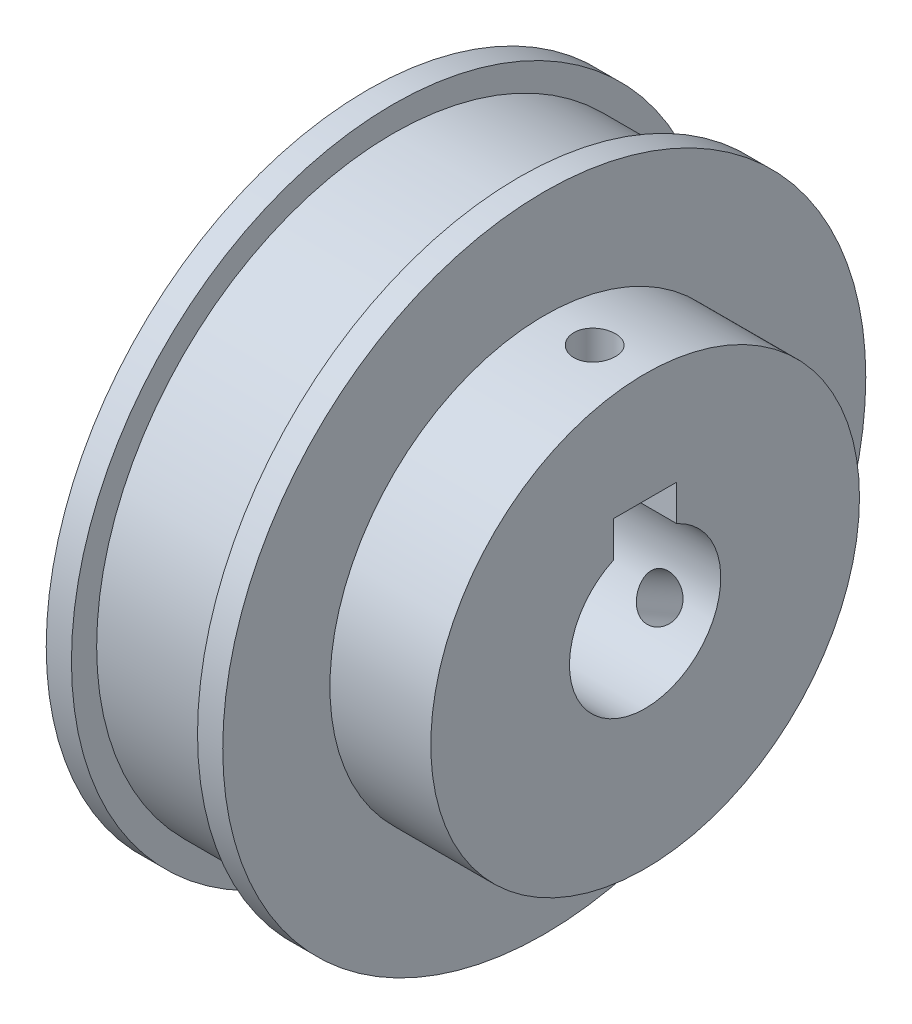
ISO-10303-21;
HEADER;
FILE_DESCRIPTION(('STEP AP214'),'2;1');
FILE_NAME('part.step','',(''),(''),'','','');
FILE_SCHEMA(('AUTOMOTIVE_DESIGN { 1 0 10303 214 1 1 1 1 }'));
ENDSEC;
DATA;
#1=APPLICATION_CONTEXT('core data for automotive mechanical design processes');
#2=APPLICATION_PROTOCOL_DEFINITION('international standard','automotive_design',2000,#1);
#3=PRODUCT_CONTEXT('',#1,'mechanical');
#4=PRODUCT('Part','Part','',(#3));
#5=PRODUCT_RELATED_PRODUCT_CATEGORY('part','',(#4));
#6=PRODUCT_DEFINITION_FORMATION('','',#4);
#7=PRODUCT_DEFINITION_CONTEXT('part definition',#1,'design');
#8=PRODUCT_DEFINITION('design','',#6,#7);
#9=PRODUCT_DEFINITION_SHAPE('','',#8);
#10=(LENGTH_UNIT() NAMED_UNIT(*) SI_UNIT(.MILLI.,.METRE.));
#11=(NAMED_UNIT(*) PLANE_ANGLE_UNIT() SI_UNIT($,.RADIAN.));
#12=(NAMED_UNIT(*) SI_UNIT($,.STERADIAN.) SOLID_ANGLE_UNIT());
#13=UNCERTAINTY_MEASURE_WITH_UNIT(LENGTH_MEASURE(1.E-05),#10,'distance_accuracy_value','');
#14=(GEOMETRIC_REPRESENTATION_CONTEXT(3) GLOBAL_UNCERTAINTY_ASSIGNED_CONTEXT((#13)) GLOBAL_UNIT_ASSIGNED_CONTEXT((#10,
#11,#12)) REPRESENTATION_CONTEXT('',''));
#15=CARTESIAN_POINT('',(0.,0.,0.));
#16=DIRECTION('',(0.,0.,1.));
#17=DIRECTION('',(1.,0.,0.));
#18=AXIS2_PLACEMENT_3D('',#15,#16,#17);
#19=CARTESIAN_POINT('',(14.,0.,0.));
#20=DIRECTION('',(1.,0.,0.));
#21=DIRECTION('',(0.,0.,-1.));
#22=AXIS2_PLACEMENT_3D('',#19,#20,#21);
#23=CYLINDRICAL_SURFACE('',#22,17.);
#24=CARTESIAN_POINT('',(18.,16.9197369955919,-1.65));
#25=CARTESIAN_POINT('',(18.092446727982,16.9197380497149,-1.64999598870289));
#26=CARTESIAN_POINT('',(18.1849549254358,16.9205028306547,-1.64220438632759));
#27=CARTESIAN_POINT('',(18.3674074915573,16.9234789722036,-1.61123929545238));
#28=CARTESIAN_POINT('',(18.4573489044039,16.9256919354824,-1.58804876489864));
#29=CARTESIAN_POINT('',(18.6319992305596,16.931311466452,-1.52696658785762));
#30=CARTESIAN_POINT('',(18.7167112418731,16.9347173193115,-1.4890837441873));
#31=CARTESIAN_POINT('',(18.8785557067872,16.9423379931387,-1.39970897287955));
#32=CARTESIAN_POINT('',(18.9556896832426,16.9465526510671,-1.34821978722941));
#33=CARTESIAN_POINT('',(19.100472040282,16.9553322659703,-1.23290381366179));
#34=CARTESIAN_POINT('',(19.1680907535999,16.9598982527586,-1.16903985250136));
#35=CARTESIAN_POINT('',(19.2916677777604,16.9688566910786,-1.03086650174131));
#36=CARTESIAN_POINT('',(19.3476255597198,16.973249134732,-0.956556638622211));
#37=CARTESIAN_POINT('',(19.4463941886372,16.981375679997,-0.799419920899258));
#38=CARTESIAN_POINT('',(19.4891788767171,16.9851084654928,-0.71657655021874));
#39=CARTESIAN_POINT('',(19.5602194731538,16.9914839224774,-0.544839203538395));
#40=CARTESIAN_POINT('',(19.588475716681,16.9941266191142,-0.455945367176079));
#41=CARTESIAN_POINT('',(19.6295705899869,16.9980169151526,-0.274929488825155));
#42=CARTESIAN_POINT('',(19.64245782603,16.9992689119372,-0.182818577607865));
#43=CARTESIAN_POINT('',(19.6525992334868,17.0002516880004,0.00226671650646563));
#44=CARTESIAN_POINT('',(19.6498537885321,16.9999825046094,0.0952410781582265));
#45=CARTESIAN_POINT('',(19.6288472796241,16.9979568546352,0.279084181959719));
#46=CARTESIAN_POINT('',(19.6106384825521,16.996205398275,0.369958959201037));
#47=CARTESIAN_POINT('',(19.5593035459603,16.9914178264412,0.547356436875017));
#48=CARTESIAN_POINT('',(19.5261772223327,16.9883816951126,0.633879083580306));
#49=CARTESIAN_POINT('',(19.4458900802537,16.9813575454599,0.800281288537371));
#50=CARTESIAN_POINT('',(19.3987060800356,16.9773679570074,0.880149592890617));
#51=CARTESIAN_POINT('',(19.2916597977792,16.9688846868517,1.03085313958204));
#52=CARTESIAN_POINT('',(19.2317971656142,16.964390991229,1.10168813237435));
#53=CARTESIAN_POINT('',(19.1007988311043,16.9553820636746,1.23262034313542));
#54=CARTESIAN_POINT('',(19.0296176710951,16.9508668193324,1.29267208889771));
#55=CARTESIAN_POINT('',(18.8781606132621,16.9423422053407,1.39998125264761));
#56=CARTESIAN_POINT('',(18.7978847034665,16.9383328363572,1.44723865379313));
#57=CARTESIAN_POINT('',(18.6304825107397,16.9312734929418,1.52761715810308));
#58=CARTESIAN_POINT('',(18.5433549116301,16.9282237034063,1.56073553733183));
#59=CARTESIAN_POINT('',(18.3647394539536,16.9234326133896,1.61186034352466));
#60=CARTESIAN_POINT('',(18.2732517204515,16.9216912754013,1.62986720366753));
#61=CARTESIAN_POINT('',(18.0889119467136,16.9197206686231,1.65019950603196));
#62=CARTESIAN_POINT('',(17.996066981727,16.9194852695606,1.65258852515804));
#63=CARTESIAN_POINT('',(17.8112980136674,16.9205370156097,1.64178421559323));
#64=CARTESIAN_POINT('',(17.7193739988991,16.9218241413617,1.62859108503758));
#65=CARTESIAN_POINT('',(17.5392411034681,16.9257703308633,1.58705013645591));
#66=CARTESIAN_POINT('',(17.451025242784,16.9284266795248,1.55873230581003));
#67=CARTESIAN_POINT('',(17.2805959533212,16.9348097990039,1.48777638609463));
#68=CARTESIAN_POINT('',(17.198382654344,16.9385365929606,1.44513798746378));
#69=CARTESIAN_POINT('',(17.04200221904,16.9466555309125,1.34659170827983));
#70=CARTESIAN_POINT('',(16.9678617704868,16.951049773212,1.29064165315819));
#71=CARTESIAN_POINT('',(16.8300020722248,16.9600015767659,1.16712081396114));
#72=CARTESIAN_POINT('',(16.7662830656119,16.9645591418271,1.09954975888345));
#73=CARTESIAN_POINT('',(16.6508561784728,16.9733425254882,0.954429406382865));
#74=CARTESIAN_POINT('',(16.5991897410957,16.9775671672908,0.876847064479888));
#75=CARTESIAN_POINT('',(16.5096196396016,16.9851916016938,0.71406990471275));
#76=CARTESIAN_POINT('',(16.4717157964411,16.9885914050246,0.628875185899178));
#77=CARTESIAN_POINT('',(16.4108172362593,16.9941777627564,0.453437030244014));
#78=CARTESIAN_POINT('',(16.3877973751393,16.9963663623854,0.363202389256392));
#79=CARTESIAN_POINT('',(16.3572381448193,16.9992920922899,0.180126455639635));
#80=CARTESIAN_POINT('',(16.349698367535,17.0000292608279,0.0872852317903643));
#81=CARTESIAN_POINT('',(16.3503188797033,16.9999690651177,-0.0979611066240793));
#82=CARTESIAN_POINT('',(16.3584147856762,16.9991779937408,-0.190366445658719));
#83=CARTESIAN_POINT('',(16.3899419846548,16.9961626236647,-0.372497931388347));
#84=CARTESIAN_POINT('',(16.4133732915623,16.9939383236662,-0.4622240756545));
#85=CARTESIAN_POINT('',(16.4748885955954,16.9883057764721,-0.636450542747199));
#86=CARTESIAN_POINT('',(16.5129708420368,16.9848976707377,-0.720951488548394));
#87=CARTESIAN_POINT('',(16.602700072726,16.977277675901,-0.882371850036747));
#88=CARTESIAN_POINT('',(16.6543469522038,16.973065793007,-0.959291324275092));
#89=CARTESIAN_POINT('',(16.7699809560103,16.9642895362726,-1.10369520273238));
#90=CARTESIAN_POINT('',(16.834015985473,16.9597238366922,-1.17114116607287));
#91=CARTESIAN_POINT('',(16.9725152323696,16.9507657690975,-1.29435973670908));
#92=CARTESIAN_POINT('',(17.0469819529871,16.9463734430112,-1.3501295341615));
#93=CARTESIAN_POINT('',(17.2044258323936,16.9382480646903,-1.44851751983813));
#94=CARTESIAN_POINT('',(17.2874230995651,16.9345166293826,-1.49110363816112));
#95=CARTESIAN_POINT('',(17.459372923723,16.9281548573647,-1.56167867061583));
#96=CARTESIAN_POINT('',(17.5483186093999,16.9255232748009,-1.58968410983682));
#97=CARTESIAN_POINT('',(17.6981433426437,16.9223253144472,-1.62329077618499));
#98=CARTESIAN_POINT('',(17.7580633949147,16.9213592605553,-1.63329311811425));
#99=CARTESIAN_POINT('',(17.8786468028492,16.9200647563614,-1.64664903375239));
#100=CARTESIAN_POINT('',(17.939310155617,16.9197363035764,-1.65000263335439));
#101=CARTESIAN_POINT('',(18.,16.9197369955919,-1.65));
#102=B_SPLINE_CURVE_WITH_KNOTS('',3,(#24,#25,#26,#27,#28,#29,#30,#31,#32,#33,#34,#35,#36,#37,
#38,#39,#40,#41,#42,#43,#44,#45,#46,#47,#48,#49,#50,#51,#52,#53,#54,#55,#56,#57,#58,#59,#60,#61,
#62,#63,#64,#65,#66,#67,#68,#69,#70,#71,#72,#73,#74,#75,#76,#77,#78,#79,#80,#81,#82,#83,#84,#85,
#86,#87,#88,#89,#90,#91,#92,#93,#94,#95,#96,#97,#98,#99,#100,#101),.UNSPECIFIED.,.T.,.F.,(4,2,2,
2,2,2,2,2,2,2,2,2,2,2,2,2,2,2,2,2,2,2,2,2,2,2,2,2,2,2,2,2,2,2,2,2,2,2,4),(0.,0.277118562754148,
0.554544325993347,0.831804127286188,1.10900809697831,1.38705805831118,1.665120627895,
1.94373185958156,2.22233666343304,2.50005799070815,2.77777250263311,3.05455204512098,
3.33133500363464,3.60857694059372,3.88582653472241,4.16421913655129,4.44261210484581,
4.72105868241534,4.99949727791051,5.27680169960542,5.55410259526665,5.83085572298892,
6.10761483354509,6.38526274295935,6.66291712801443,6.94151260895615,7.22010446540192,
7.4982244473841,7.77633709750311,8.05330699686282,8.3302771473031,8.60721421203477,
8.88414913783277,9.16217719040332,9.44027207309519,9.71903821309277,9.99748772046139,
10.1794124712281,10.3613365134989),.UNSPECIFIED.);
#103=CARTESIAN_POINT('',(18.,16.9197369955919,-1.65));
#104=VERTEX_POINT('',#103);
#105=EDGE_CURVE('E131',#104,#104,#102,.T.);
#106=ORIENTED_EDGE('',*,*,#105,.T.);
#107=EDGE_LOOP('',(#106));
#108=FACE_BOUND('',#107,.T.);
#109=CARTESIAN_POINT('',(14.,0.,0.));
#110=DIRECTION('',(1.,0.,0.));
#111=DIRECTION('',(0.,0.,-1.));
#112=AXIS2_PLACEMENT_3D('',#109,#110,#111);
#113=CIRCLE('',#112,17.);
#114=CARTESIAN_POINT('',(14.,0.,-17.));
#115=VERTEX_POINT('',#114);
#116=EDGE_CURVE('E109',#115,#115,#113,.T.);
#117=ORIENTED_EDGE('',*,*,#116,.T.);
#118=EDGE_LOOP('',(#117));
#119=FACE_BOUND('',#118,.T.);
#120=CARTESIAN_POINT('',(22.,0.,0.));
#121=DIRECTION('',(1.,0.,0.));
#122=DIRECTION('',(0.,0.,-1.));
#123=AXIS2_PLACEMENT_3D('',#120,#121,#122);
#124=CIRCLE('',#123,17.);
#125=CARTESIAN_POINT('',(22.,0.,-17.));
#126=VERTEX_POINT('',#125);
#127=EDGE_CURVE('E106',#126,#126,#124,.T.);
#128=ORIENTED_EDGE('',*,*,#127,.F.);
#129=EDGE_LOOP('',(#128));
#130=FACE_BOUND('',#129,.T.);
#131=CARTESIAN_POINT('',(18.,-9.88881041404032,-13.8279220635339));
#132=CARTESIAN_POINT('',(18.092446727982,-9.88880746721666,-13.8279249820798));
#133=CARTESIAN_POINT('',(18.1849549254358,-9.88244213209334,-13.8324831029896));
#134=CARTESIAN_POINT('',(18.3674074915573,-9.85711364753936,-13.8505430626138));
#135=CARTESIAN_POINT('',(18.4573489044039,-9.83813654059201,-13.8640548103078));
#136=CARTESIAN_POINT('',(18.6319992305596,-9.78804758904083,-13.8994625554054));
#137=CARTESIAN_POINT('',(18.7167112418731,-9.75694301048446,-13.9213535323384));
#138=CARTESIAN_POINT('',(18.8785557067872,-9.68335252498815,-13.9726406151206));
#139=CARTESIAN_POINT('',(18.9556896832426,-9.64086891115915,-14.0020352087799));
#140=CARTESIAN_POINT('',(19.100472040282,-9.54539215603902,-14.0672965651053));
#141=CARTESIAN_POINT('',(19.1680907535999,-9.49236733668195,-14.1031828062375));
#142=CARTESIAN_POINT('',(19.2916677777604,-9.37718492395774,-14.1800277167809));
#143=CARTESIAN_POINT('',(19.3476255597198,-9.31502691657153,-14.220986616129));
#144=CARTESIAN_POINT('',(19.4463941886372,-9.18300579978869,-14.306592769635));
#145=CARTESIAN_POINT('',(19.4891788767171,-9.11312772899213,-14.3512471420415));
#146=CARTESIAN_POINT('',(19.5602194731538,-8.96758655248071,-14.4426371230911));
#147=CARTESIAN_POINT('',(19.588475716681,-8.89192358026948,-14.4893726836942));
#148=CARTESIAN_POINT('',(19.6295705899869,-8.73710437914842,-14.5832497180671));
#149=CARTESIAN_POINT('',(19.64245782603,-8.6579599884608,-14.6303894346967));
#150=CARTESIAN_POINT('',(19.6525992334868,-8.49816280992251,-14.7237831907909));
#151=CARTESIAN_POINT('',(19.6498537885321,-8.41751005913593,-14.7700372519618));
#152=CARTESIAN_POINT('',(19.6288472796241,-8.25728443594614,-14.8602045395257));
#153=CARTESIAN_POINT('',(19.6106384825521,-8.17770884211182,-14.9041251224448));
#154=CARTESIAN_POINT('',(19.5593035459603,-8.02168433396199,-14.9886777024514));
#155=CARTESIAN_POINT('',(19.5261772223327,-7.94523545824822,-15.0293096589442));
#156=CARTESIAN_POINT('',(19.4458900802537,-7.7976148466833,-15.1064276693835));
#157=CARTESIAN_POINT('',(19.3987060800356,-7.72645207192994,-15.1429067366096));
#158=CARTESIAN_POINT('',(19.2916597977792,-7.59169733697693,-15.2109117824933));
#159=CARTESIAN_POINT('',(19.2317971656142,-7.52810558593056,-15.2424376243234));
#160=CARTESIAN_POINT('',(19.1007988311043,-7.4102105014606,-15.3001017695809));
#161=CARTESIAN_POINT('',(19.0296176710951,-7.35594654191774,-15.3262173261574));
#162=CARTESIAN_POINT('',(18.8781606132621,-7.25875177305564,-15.3724893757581));
#163=CARTESIAN_POINT('',(18.7978847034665,-7.21582097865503,-15.392645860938));
#164=CARTESIAN_POINT('',(18.6304825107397,-7.14268148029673,-15.4267215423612));
#165=CARTESIAN_POINT('',(18.5433549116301,-7.11247522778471,-15.4406395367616));
#166=CARTESIAN_POINT('',(18.3647394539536,-7.06580430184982,-15.4620527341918));
#167=CARTESIAN_POINT('',(18.2732517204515,-7.04933923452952,-15.4695481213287));
#168=CARTESIAN_POINT('',(18.0889119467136,-7.0307456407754,-15.4780076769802));
#169=CARTESIAN_POINT('',(17.996066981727,-7.02855898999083,-15.478998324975));
#170=CARTESIAN_POINT('',(17.8112980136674,-7.03844166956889,-15.4745070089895));
#171=CARTESIAN_POINT('',(17.7193739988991,-7.05051081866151,-15.4690251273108));
#172=CARTESIAN_POINT('',(17.5392411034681,-7.08845943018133,-15.4516721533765));
#173=CARTESIAN_POINT('',(17.451025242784,-7.11431156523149,-15.4398137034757));
#174=CARTESIAN_POINT('',(17.2805959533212,-7.17895275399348,-15.4098636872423));
#175=CARTESIAN_POINT('',(17.198382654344,-7.21774208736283,-15.3917719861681));
#176=CARTESIAN_POINT('',(17.04200221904,-7.3071451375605,-15.3495300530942));
#177=CARTESIAN_POINT('',(16.9678617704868,-7.35779642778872,-15.3253605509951));
#178=CARTESIAN_POINT('',(16.8300020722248,-7.46924451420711,-15.2713526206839));
#179=CARTESIAN_POINT('',(16.7662830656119,-7.53004154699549,-15.2415140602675));
#180=CARTESIAN_POINT('',(16.6508561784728,-7.66011115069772,-15.1765605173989));
#181=CARTESIAN_POINT('',(16.5991897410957,-7.72941175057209,-15.1414279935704));
#182=CARTESIAN_POINT('',(16.5096196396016,-7.87419312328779,-15.0666423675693));
#183=CARTESIAN_POINT('',(16.4717157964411,-7.94967381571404,-15.0269893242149));
#184=CARTESIAN_POINT('',(16.4108172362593,-8.10440089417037,-14.9441081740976));
#185=CARTESIAN_POINT('',(16.3877973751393,-8.18364068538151,-14.9008862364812));
#186=CARTESIAN_POINT('',(16.3572381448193,-8.34365195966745,-14.8118820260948));
#187=CARTESIAN_POINT('',(16.349698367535,-8.42442340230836,-14.7660998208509));
#188=CARTESIAN_POINT('',(16.3503188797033,-8.58482133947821,-14.6734245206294));
#189=CARTESIAN_POINT('',(16.3584147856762,-8.66445117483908,-14.6265367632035));
#190=CARTESIAN_POINT('',(16.3899419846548,-8.82067398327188,-14.532859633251));
#191=CARTESIAN_POINT('',(16.4133732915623,-8.89726695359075,-14.4860702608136));
#192=CARTESIAN_POINT('',(16.4748885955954,-9.04533522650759,-14.3940790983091));
#193=CARTESIAN_POINT('',(16.5129708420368,-9.11681113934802,-14.3488771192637));
#194=CARTESIAN_POINT('',(16.602700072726,-9.25279527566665,-14.2615678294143));
#195=CARTESIAN_POINT('',(16.6543469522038,-9.31730355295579,-14.2194604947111));
#196=CARTESIAN_POINT('',(16.7699809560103,-9.43797285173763,-14.1396580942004));
#197=CARTESIAN_POINT('',(16.834015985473,-9.49409991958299,-14.1019811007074));
#198=CARTESIAN_POINT('',(16.9725152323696,-9.59633129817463,-14.0326139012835));
#199=CARTESIAN_POINT('',(17.0469819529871,-9.64243319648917,-14.0009251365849));
#200=CARTESIAN_POINT('',(17.2044258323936,-9.72357700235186,-13.9446943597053));
#201=CARTESIAN_POINT('',(17.2874230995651,-9.75859194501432,-13.9201697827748));
#202=CARTESIAN_POINT('',(17.4593729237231,-9.81653082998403,-13.8793728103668));
#203=CARTESIAN_POINT('',(17.5483186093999,-9.83946846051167,-13.8630910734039));
#204=CARTESIAN_POINT('',(17.6981433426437,-9.86697370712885,-13.8435182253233));
#205=CARTESIAN_POINT('',(17.7580633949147,-9.87515296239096,-13.8376804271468));
#206=CARTESIAN_POINT('',(17.8786468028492,-9.88607227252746,-13.8298813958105));
#207=CARTESIAN_POINT('',(17.939310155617,-9.88881234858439,-13.8279201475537));
#208=CARTESIAN_POINT('',(18.,-9.88881041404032,-13.8279220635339));
#209=B_SPLINE_CURVE_WITH_KNOTS('',3,(#131,#132,#133,#134,#135,#136,#137,#138,#139,#140,#141,
#142,#143,#144,#145,#146,#147,#148,#149,#150,#151,#152,#153,#154,#155,#156,#157,#158,#159,#160,
#161,#162,#163,#164,#165,#166,#167,#168,#169,#170,#171,#172,#173,#174,#175,#176,#177,#178,#179,
#180,#181,#182,#183,#184,#185,#186,#187,#188,#189,#190,#191,#192,#193,#194,#195,#196,#197,#198,
#199,#200,#201,#202,#203,#204,#205,#206,#207,#208),.UNSPECIFIED.,.T.,.F.,(4,2,2,2,2,2,2,2,2,2,2,
2,2,2,2,2,2,2,2,2,2,2,2,2,2,2,2,2,2,2,2,2,2,2,2,2,2,2,4),(0.,0.277118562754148,
0.554544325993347,0.831804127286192,1.10900809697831,1.38705805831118,1.665120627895,
1.94373185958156,2.22233666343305,2.50005799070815,2.77777250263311,3.05455204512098,
3.33133500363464,3.60857694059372,3.88582653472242,4.16421913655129,4.44261210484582,
4.72105868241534,4.99949727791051,5.27680169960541,5.55410259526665,5.83085572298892,
6.10761483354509,6.38526274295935,6.66291712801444,6.94151260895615,7.22010446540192,
7.4982244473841,7.77633709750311,8.05330699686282,8.3302771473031,8.60721421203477,
8.88414913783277,9.16217719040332,9.4402720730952,9.71903821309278,9.9974877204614,
10.1794124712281,10.3613365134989),.UNSPECIFIED.);
#210=CARTESIAN_POINT('',(18.,-9.88881041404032,-13.8279220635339));
#211=VERTEX_POINT('',#210);
#212=EDGE_CURVE('E132',#211,#211,#209,.T.);
#213=ORIENTED_EDGE('',*,*,#212,.T.);
#214=EDGE_LOOP('',(#213));
#215=FACE_BOUND('',#214,.T.);
#216=ADVANCED_FACE('F33',(#108,#119,#130,#215),#23,.T.);
#217=CARTESIAN_POINT('',(0.,0.,0.));
#218=DIRECTION('',(1.,0.,0.));
#219=DIRECTION('',(0.,0.,-1.));
#220=AXIS2_PLACEMENT_3D('',#217,#218,#219);
#221=CYLINDRICAL_SURFACE('',#220,6.);
#222=CARTESIAN_POINT('',(22.,0.,0.));
#223=DIRECTION('',(1.,0.,0.));
#224=DIRECTION('',(0.,0.,-1.));
#225=AXIS2_PLACEMENT_3D('',#222,#223,#224);
#226=CIRCLE('',#225,6.);
#227=CARTESIAN_POINT('',(22.,5.45435605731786,2.5));
#228=VERTEX_POINT('',#227);
#229=CARTESIAN_POINT('',(22.,5.45435605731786,-2.5));
#230=VERTEX_POINT('',#229);
#231=EDGE_CURVE('E102',#228,#230,#226,.T.);
#232=ORIENTED_EDGE('',*,*,#231,.T.);
#233=DIRECTION('',(1.,0.,0.));
#234=VECTOR('',#233,1.);
#235=CARTESIAN_POINT('',(0.,5.45435605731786,-2.5));
#236=LINE('',#235,#234);
#237=CARTESIAN_POINT('',(0.,5.45435605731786,-2.5));
#238=VERTEX_POINT('',#237);
#239=EDGE_CURVE('E86',#238,#230,#236,.T.);
#240=ORIENTED_EDGE('',*,*,#239,.F.);
#241=CARTESIAN_POINT('',(0.,0.,0.));
#242=DIRECTION('',(1.,0.,0.));
#243=DIRECTION('',(0.,0.,-1.));
#244=AXIS2_PLACEMENT_3D('',#241,#242,#243);
#245=CIRCLE('',#244,6.);
#246=CARTESIAN_POINT('',(0.,5.45435605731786,2.5));
#247=VERTEX_POINT('',#246);
#248=EDGE_CURVE('E100',#247,#238,#245,.T.);
#249=ORIENTED_EDGE('',*,*,#248,.F.);
#250=DIRECTION('',(1.,0.,0.));
#251=VECTOR('',#250,1.);
#252=CARTESIAN_POINT('',(0.,5.45435605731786,2.5));
#253=LINE('',#252,#251);
#254=EDGE_CURVE('E77',#247,#228,#253,.T.);
#255=ORIENTED_EDGE('',*,*,#254,.T.);
#256=EDGE_LOOP('',(#232,#240,#249,#255));
#257=FACE_BOUND('',#256,.T.);
#258=CARTESIAN_POINT('',(18.,-4.31327459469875,-4.17081074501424));
#259=CARTESIAN_POINT('',(18.0907804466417,-4.31327362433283,-4.17081298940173));
#260=CARTESIAN_POINT('',(18.1815812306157,-4.30784748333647,-4.17644554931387));
#261=CARTESIAN_POINT('',(18.3605527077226,-4.28623748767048,-4.19861883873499));
#262=CARTESIAN_POINT('',(18.4487221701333,-4.27004867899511,-4.21516459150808));
#263=CARTESIAN_POINT('',(18.6198157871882,-4.2272222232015,-4.25811029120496));
#264=CARTESIAN_POINT('',(18.7027474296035,-4.20059990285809,-4.28449578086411));
#265=CARTESIAN_POINT('',(18.8613672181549,-4.13731330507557,-4.34563766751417));
#266=CARTESIAN_POINT('',(18.9370546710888,-4.10064806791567,-4.38039486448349));
#267=CARTESIAN_POINT('',(19.0810504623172,-4.0167854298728,-4.45743715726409));
#268=CARTESIAN_POINT('',(19.149137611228,-3.96935598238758,-4.49988316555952));
#269=CARTESIAN_POINT('',(19.274041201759,-3.86518479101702,-4.58966967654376));
#270=CARTESIAN_POINT('',(19.3308564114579,-3.80844203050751,-4.63701071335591));
#271=CARTESIAN_POINT('',(19.432534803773,-3.68551698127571,-4.73531982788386));
#272=CARTESIAN_POINT('',(19.4771767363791,-3.6191897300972,-4.78633612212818));
#273=CARTESIAN_POINT('',(19.5517961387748,-3.47920383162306,-4.88903512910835));
#274=CARTESIAN_POINT('',(19.5817762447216,-3.40554650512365,-4.94071772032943));
#275=CARTESIAN_POINT('',(19.6255012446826,-3.25457524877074,-5.04140546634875));
#276=CARTESIAN_POINT('',(19.6396227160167,-3.17739355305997,-5.09044516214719));
#277=CARTESIAN_POINT('',(19.6524157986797,-3.01991108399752,-5.18542050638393));
#278=CARTESIAN_POINT('',(19.6510901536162,-2.93961086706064,-5.23135670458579));
#279=CARTESIAN_POINT('',(19.6332888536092,-2.78049542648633,-5.31759535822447));
#280=CARTESIAN_POINT('',(19.6172202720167,-2.70169809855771,-5.35801582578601));
#281=CARTESIAN_POINT('',(19.5710486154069,-2.54581558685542,-5.43381442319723));
#282=CARTESIAN_POINT('',(19.5409447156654,-2.46873050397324,-5.46919225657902));
#283=CARTESIAN_POINT('',(19.4672538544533,-2.3178264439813,-5.53484670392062));
#284=CARTESIAN_POINT('',(19.4235301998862,-2.24404966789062,-5.56506656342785));
#285=CARTESIAN_POINT('',(19.3239466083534,-2.10288583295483,-5.61993016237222));
#286=CARTESIAN_POINT('',(19.268084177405,-2.03550009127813,-5.64457275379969));
#287=CARTESIAN_POINT('',(19.1436593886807,-1.90718105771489,-5.68923818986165));
#288=CARTESIAN_POINT('',(19.0747424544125,-1.84652964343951,-5.70908429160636));
#289=CARTESIAN_POINT('',(18.927279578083,-1.73646383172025,-5.74352055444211));
#290=CARTESIAN_POINT('',(18.8487329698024,-1.68705021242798,-5.75811035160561));
#291=CARTESIAN_POINT('',(18.683482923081,-1.60111117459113,-5.78259997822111));
#292=CARTESIAN_POINT('',(18.5967268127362,-1.56467728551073,-5.79246666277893));
#293=CARTESIAN_POINT('',(18.4179783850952,-1.5068294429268,-5.80778533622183));
#294=CARTESIAN_POINT('',(18.3259874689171,-1.48541149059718,-5.81323850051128));
#295=CARTESIAN_POINT('',(18.1425035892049,-1.45906904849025,-5.81990529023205));
#296=CARTESIAN_POINT('',(18.0510871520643,-1.45364360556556,-5.82124773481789));
#297=CARTESIAN_POINT('',(17.8686614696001,-1.45812266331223,-5.82012749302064));
#298=CARTESIAN_POINT('',(17.7776521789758,-1.46802541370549,-5.81766524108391));
#299=CARTESIAN_POINT('',(17.6005811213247,-1.502312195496,-5.80890325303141));
#300=CARTESIAN_POINT('',(17.5144558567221,-1.52639120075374,-5.80268427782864));
#301=CARTESIAN_POINT('',(17.3474483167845,-1.58772690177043,-5.78620127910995));
#302=CARTESIAN_POINT('',(17.2665667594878,-1.62498539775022,-5.775936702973));
#303=CARTESIAN_POINT('',(17.1102719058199,-1.71221465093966,-5.75068884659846));
#304=CARTESIAN_POINT('',(17.0350288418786,-1.76246008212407,-5.73560169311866));
#305=CARTESIAN_POINT('',(16.8939956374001,-1.87336633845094,-5.70034016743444));
#306=CARTESIAN_POINT('',(16.8282073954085,-1.9340292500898,-5.68016477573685));
#307=CARTESIAN_POINT('',(16.7058566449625,-2.06575142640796,-5.63362143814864));
#308=CARTESIAN_POINT('',(16.6496430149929,-2.13707451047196,-5.60708103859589));
#309=CARTESIAN_POINT('',(16.5506069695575,-2.28621888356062,-5.54793915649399));
#310=CARTESIAN_POINT('',(16.5077838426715,-2.36403982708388,-5.51533799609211));
#311=CARTESIAN_POINT('',(16.4371455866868,-2.52297737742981,-5.44445504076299));
#312=CARTESIAN_POINT('',(16.4092172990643,-2.60406395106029,-5.40621897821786));
#313=CARTESIAN_POINT('',(16.3688404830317,-2.7674078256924,-5.32445159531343));
#314=CARTESIAN_POINT('',(16.3563882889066,-2.84966484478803,-5.2809215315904));
#315=CARTESIAN_POINT('',(16.3475588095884,-3.01003117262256,-5.19113516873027));
#316=CARTESIAN_POINT('',(16.3506712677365,-3.08818832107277,-5.14501380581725));
#317=CARTESIAN_POINT('',(16.3716895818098,-3.2408779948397,-5.05022623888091));
#318=CARTESIAN_POINT('',(16.3895948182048,-3.315410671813,-5.00156014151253));
#319=CARTESIAN_POINT('',(16.4393947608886,-3.45838888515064,-4.90377376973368));
#320=CARTESIAN_POINT('',(16.4711801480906,-3.52687705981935,-4.85465992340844));
#321=CARTESIAN_POINT('',(16.5477408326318,-3.65695857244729,-4.75744211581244));
#322=CARTESIAN_POINT('',(16.5925180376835,-3.71855089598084,-4.7093383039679));
#323=CARTESIAN_POINT('',(16.6952520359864,-3.83536377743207,-4.61473686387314));
#324=CARTESIAN_POINT('',(16.7535428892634,-3.89035751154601,-4.56832197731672));
#325=CARTESIAN_POINT('',(16.8810237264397,-3.99105044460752,-4.48062318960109));
#326=CARTESIAN_POINT('',(16.9502166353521,-4.03674714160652,-4.43934067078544));
#327=CARTESIAN_POINT('',(17.0995178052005,-4.11915189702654,-4.36300634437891));
#328=CARTESIAN_POINT('',(17.1798466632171,-4.15562013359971,-4.3281262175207));
#329=CARTESIAN_POINT('',(17.3479256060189,-4.21753730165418,-4.26781669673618));
#330=CARTESIAN_POINT('',(17.4356710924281,-4.24299300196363,-4.24238149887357));
#331=CARTESIAN_POINT('',(17.6024963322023,-4.27950654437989,-4.20551885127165));
#332=CARTESIAN_POINT('',(17.6808962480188,-4.29215338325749,-4.19256057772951));
#333=CARTESIAN_POINT('',(17.8395256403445,-4.30903728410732,-4.17520609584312));
#334=CARTESIAN_POINT('',(17.9197548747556,-4.31327545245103,-4.17080876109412));
#335=CARTESIAN_POINT('',(18.,-4.31327459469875,-4.17081074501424));
#336=B_SPLINE_CURVE_WITH_KNOTS('',3,(#258,#259,#260,#261,#262,#263,#264,#265,#266,#267,#268,
#269,#270,#271,#272,#273,#274,#275,#276,#277,#278,#279,#280,#281,#282,#283,#284,#285,#286,#287,
#288,#289,#290,#291,#292,#293,#294,#295,#296,#297,#298,#299,#300,#301,#302,#303,#304,#305,#306,
#307,#308,#309,#310,#311,#312,#313,#314,#315,#316,#317,#318,#319,#320,#321,#322,#323,#324,#325,
#326,#327,#328,#329,#330,#331,#332,#333,#334,#335),.UNSPECIFIED.,.T.,.F.,(4,2,2,2,2,2,2,2,2,2,2,
2,2,2,2,2,2,2,2,2,2,2,2,2,2,2,2,2,2,2,2,2,2,2,2,2,2,2,4),(0.,0.272046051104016,0.54421741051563,
0.815990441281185,1.08778945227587,1.36612384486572,1.64448864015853,1.92761862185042,
2.21069767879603,2.48690242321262,2.76305811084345,3.03181099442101,3.30057967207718,
3.57213780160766,3.84375177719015,4.12421818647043,4.40470401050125,4.68713031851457,
4.9694813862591,5.24288876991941,5.5162649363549,5.78396348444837,6.0516986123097,
6.32564040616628,6.59963713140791,6.88212071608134,7.16458929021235,7.44488018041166,
7.72510466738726,7.9962039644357,8.26729190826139,8.5362822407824,8.80531209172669,
9.08187822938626,9.35851869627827,9.64174339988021,9.92479377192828,10.1652997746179,
10.4057741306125),.UNSPECIFIED.);
#337=CARTESIAN_POINT('',(18.,-4.31327459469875,-4.17081074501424));
#338=VERTEX_POINT('',#337);
#339=EDGE_CURVE('E37',#338,#338,#336,.T.);
#340=ORIENTED_EDGE('',*,*,#339,.F.);
#341=EDGE_LOOP('',(#340));
#342=FACE_BOUND('',#341,.T.);
#343=ADVANCED_FACE('F98',(#257,#342),#221,.F.);
#344=CARTESIAN_POINT('',(0.,8.3,-2.5));
#345=DIRECTION('',(0.,1.,0.));
#346=DIRECTION('',(0.,0.,1.));
#347=AXIS2_PLACEMENT_3D('',#344,#345,#346);
#348=PLANE('',#347);
#349=DIRECTION('',(0.,0.,1.));
#350=VECTOR('',#349,1.);
#351=CARTESIAN_POINT('',(22.,8.3,-2.5));
#352=LINE('',#351,#350);
#353=CARTESIAN_POINT('',(22.,8.3,-2.5));
#354=VERTEX_POINT('',#353);
#355=CARTESIAN_POINT('',(22.,8.3,2.5));
#356=VERTEX_POINT('',#355);
#357=EDGE_CURVE('E306',#354,#356,#352,.T.);
#358=ORIENTED_EDGE('',*,*,#357,.T.);
#359=DIRECTION('',(1.,0.,0.));
#360=VECTOR('',#359,1.);
#361=CARTESIAN_POINT('',(0.,8.3,2.5));
#362=LINE('',#361,#360);
#363=CARTESIAN_POINT('',(0.,8.3,2.5));
#364=VERTEX_POINT('',#363);
#365=EDGE_CURVE('E62',#364,#356,#362,.T.);
#366=ORIENTED_EDGE('',*,*,#365,.F.);
#367=DIRECTION('',(0.,0.,1.));
#368=VECTOR('',#367,1.);
#369=CARTESIAN_POINT('',(0.,8.3,-2.5));
#370=LINE('',#369,#368);
#371=CARTESIAN_POINT('',(0.,8.3,-2.5));
#372=VERTEX_POINT('',#371);
#373=EDGE_CURVE('E92',#372,#364,#370,.T.);
#374=ORIENTED_EDGE('',*,*,#373,.F.);
#375=DIRECTION('',(1.,0.,0.));
#376=VECTOR('',#375,1.);
#377=CARTESIAN_POINT('',(0.,8.3,-2.5));
#378=LINE('',#377,#376);
#379=EDGE_CURVE('E88',#372,#354,#378,.T.);
#380=ORIENTED_EDGE('',*,*,#379,.T.);
#381=EDGE_LOOP('',(#358,#366,#374,#380));
#382=FACE_BOUND('',#381,.T.);
#383=CARTESIAN_POINT('',(18.,8.3,0.));
#384=DIRECTION('',(0.,1.,0.));
#385=DIRECTION('',(0.,0.,1.));
#386=AXIS2_PLACEMENT_3D('',#383,#384,#385);
#387=CIRCLE('',#386,1.65);
#388=CARTESIAN_POINT('',(18.,8.3,1.65));
#389=VERTEX_POINT('',#388);
#390=EDGE_CURVE('E129',#389,#389,#387,.F.);
#391=ORIENTED_EDGE('',*,*,#390,.F.);
#392=EDGE_LOOP('',(#391));
#393=FACE_BOUND('',#392,.T.);
#394=ADVANCED_FACE('F161',(#382,#393),#348,.F.);
#395=CARTESIAN_POINT('',(22.,0.,0.));
#396=DIRECTION('',(-1.,0.,0.));
#397=DIRECTION('',(0.,0.,1.));
#398=AXIS2_PLACEMENT_3D('',#395,#396,#397);
#399=CYLINDRICAL_SURFACE('',#398,25.5);
#400=CARTESIAN_POINT('',(12.,0.,0.));
#401=DIRECTION('',(1.,0.,0.));
#402=DIRECTION('',(0.,0.,-1.));
#403=AXIS2_PLACEMENT_3D('',#400,#401,#402);
#404=CIRCLE('',#403,25.5);
#405=CARTESIAN_POINT('',(12.,0.,-25.5));
#406=VERTEX_POINT('',#405);
#407=EDGE_CURVE('E46',#406,#406,#404,.T.);
#408=ORIENTED_EDGE('',*,*,#407,.T.);
#409=EDGE_LOOP('',(#408));
#410=FACE_BOUND('',#409,.T.);
#411=CARTESIAN_POINT('',(14.,0.,0.));
#412=DIRECTION('',(1.,0.,0.));
#413=DIRECTION('',(0.,0.,-1.));
#414=AXIS2_PLACEMENT_3D('',#411,#412,#413);
#415=CIRCLE('',#414,25.5);
#416=CARTESIAN_POINT('',(14.,0.,-25.5));
#417=VERTEX_POINT('',#416);
#418=EDGE_CURVE('E115',#417,#417,#415,.T.);
#419=ORIENTED_EDGE('',*,*,#418,.F.);
#420=EDGE_LOOP('',(#419));
#421=FACE_BOUND('',#420,.T.);
#422=ADVANCED_FACE('F35',(#410,#421),#399,.T.);
#423=CARTESIAN_POINT('',(12.,0.,0.));
#424=DIRECTION('',(1.,0.,0.));
#425=DIRECTION('',(0.,0.,-1.));
#426=AXIS2_PLACEMENT_3D('',#423,#424,#425);
#427=PLANE('',#426);
#428=CARTESIAN_POINT('',(12.,0.,0.));
#429=DIRECTION('',(1.,0.,0.));
#430=DIRECTION('',(0.,0.,-1.));
#431=AXIS2_PLACEMENT_3D('',#428,#429,#430);
#432=CIRCLE('',#431,23.5);
#433=CARTESIAN_POINT('',(12.,0.,-23.5));
#434=VERTEX_POINT('',#433);
#435=EDGE_CURVE('E117',#434,#434,#432,.T.);
#436=ORIENTED_EDGE('',*,*,#435,.T.);
#437=EDGE_LOOP('',(#436));
#438=FACE_BOUND('',#437,.T.);
#439=ORIENTED_EDGE('',*,*,#407,.F.);
#440=EDGE_LOOP('',(#439));
#441=FACE_BOUND('',#440,.T.);
#442=ADVANCED_FACE('F207',(#438,#441),#427,.F.);
#443=CARTESIAN_POINT('',(2.,0.,0.));
#444=DIRECTION('',(1.,0.,0.));
#445=DIRECTION('',(0.,0.,-1.));
#446=AXIS2_PLACEMENT_3D('',#443,#444,#445);
#447=PLANE('',#446);
#448=CARTESIAN_POINT('',(2.,0.,0.));
#449=DIRECTION('',(1.,0.,0.));
#450=DIRECTION('',(0.,0.,-1.));
#451=AXIS2_PLACEMENT_3D('',#448,#449,#450);
#452=CIRCLE('',#451,23.5);
#453=CARTESIAN_POINT('',(2.,0.,-23.5));
#454=VERTEX_POINT('',#453);
#455=EDGE_CURVE('E121',#454,#454,#452,.T.);
#456=ORIENTED_EDGE('',*,*,#455,.F.);
#457=EDGE_LOOP('',(#456));
#458=FACE_BOUND('',#457,.T.);
#459=CARTESIAN_POINT('',(2.,0.,0.));
#460=DIRECTION('',(1.,0.,0.));
#461=DIRECTION('',(0.,0.,-1.));
#462=AXIS2_PLACEMENT_3D('',#459,#460,#461);
#463=CIRCLE('',#462,25.5);
#464=CARTESIAN_POINT('',(2.,0.,-25.5));
#465=VERTEX_POINT('',#464);
#466=EDGE_CURVE('E120',#465,#465,#463,.T.);
#467=ORIENTED_EDGE('',*,*,#466,.T.);
#468=EDGE_LOOP('',(#467));
#469=FACE_BOUND('',#468,.T.);
#470=ADVANCED_FACE('F193',(#458,#469),#447,.T.);
#471=CARTESIAN_POINT('',(12.,0.,0.));
#472=DIRECTION('',(-1.,0.,0.));
#473=DIRECTION('',(0.,0.,1.));
#474=AXIS2_PLACEMENT_3D('',#471,#472,#473);
#475=CYLINDRICAL_SURFACE('',#474,23.5);
#476=ORIENTED_EDGE('',*,*,#435,.F.);
#477=EDGE_LOOP('',(#476));
#478=FACE_BOUND('',#477,.T.);
#479=ORIENTED_EDGE('',*,*,#455,.T.);
#480=EDGE_LOOP('',(#479));
#481=FACE_BOUND('',#480,.T.);
#482=ADVANCED_FACE('F196',(#478,#481),#475,.T.);
#483=CARTESIAN_POINT('',(0.,0.,0.));
#484=DIRECTION('',(1.,0.,0.));
#485=DIRECTION('',(0.,0.,-1.));
#486=AXIS2_PLACEMENT_3D('',#483,#484,#485);
#487=PLANE('',#486);
#488=ORIENTED_EDGE('',*,*,#373,.T.);
#489=DIRECTION('',(0.,-1.,0.));
#490=VECTOR('',#489,1.);
#491=CARTESIAN_POINT('',(0.,8.3,2.5));
#492=LINE('',#491,#490);
#493=EDGE_CURVE('E93',#364,#247,#492,.T.);
#494=ORIENTED_EDGE('',*,*,#493,.T.);
#495=ORIENTED_EDGE('',*,*,#248,.T.);
#496=DIRECTION('',(0.,1.,0.));
#497=VECTOR('',#496,1.);
#498=CARTESIAN_POINT('',(0.,5.45435605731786,-2.5));
#499=LINE('',#498,#497);
#500=EDGE_CURVE('E82',#238,#372,#499,.T.);
#501=ORIENTED_EDGE('',*,*,#500,.T.);
#502=EDGE_LOOP('',(#488,#494,#495,#501));
#503=FACE_BOUND('',#502,.T.);
#504=CARTESIAN_POINT('',(0.,0.,0.));
#505=DIRECTION('',(1.,0.,0.));
#506=DIRECTION('',(0.,0.,-1.));
#507=AXIS2_PLACEMENT_3D('',#504,#505,#506);
#508=CIRCLE('',#507,25.5);
#509=CARTESIAN_POINT('',(0.,0.,-25.5));
#510=VERTEX_POINT('',#509);
#511=EDGE_CURVE('E12',#510,#510,#508,.T.);
#512=ORIENTED_EDGE('',*,*,#511,.F.);
#513=EDGE_LOOP('',(#512));
#514=FACE_BOUND('',#513,.T.);
#515=ADVANCED_FACE('F104',(#503,#514),#487,.F.);
#516=ORIENTED_EDGE('',*,*,#511,.T.);
#517=EDGE_LOOP('',(#516));
#518=FACE_BOUND('',#517,.T.);
#519=ORIENTED_EDGE('',*,*,#466,.F.);
#520=EDGE_LOOP('',(#519));
#521=FACE_BOUND('',#520,.T.);
#522=ADVANCED_FACE('F190',(#518,#521),#399,.T.);
#523=CARTESIAN_POINT('',(14.,0.,0.));
#524=DIRECTION('',(1.,0.,0.));
#525=DIRECTION('',(0.,0.,-1.));
#526=AXIS2_PLACEMENT_3D('',#523,#524,#525);
#527=PLANE('',#526);
#528=ORIENTED_EDGE('',*,*,#116,.F.);
#529=EDGE_LOOP('',(#528));
#530=FACE_BOUND('',#529,.T.);
#531=ORIENTED_EDGE('',*,*,#418,.T.);
#532=EDGE_LOOP('',(#531));
#533=FACE_BOUND('',#532,.T.);
#534=ADVANCED_FACE('F184',(#530,#533),#527,.T.);
#535=CARTESIAN_POINT('',(22.,0.,0.));
#536=DIRECTION('',(1.,0.,0.));
#537=DIRECTION('',(0.,0.,-1.));
#538=AXIS2_PLACEMENT_3D('',#535,#536,#537);
#539=PLANE('',#538);
#540=DIRECTION('',(0.,-1.,0.));
#541=VECTOR('',#540,1.);
#542=CARTESIAN_POINT('',(22.,8.3,2.5));
#543=LINE('',#542,#541);
#544=EDGE_CURVE('E54',#356,#228,#543,.T.);
#545=ORIENTED_EDGE('',*,*,#544,.F.);
#546=ORIENTED_EDGE('',*,*,#357,.F.);
#547=DIRECTION('',(0.,1.,0.));
#548=VECTOR('',#547,1.);
#549=CARTESIAN_POINT('',(22.,5.45435605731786,-2.5));
#550=LINE('',#549,#548);
#551=EDGE_CURVE('E307',#230,#354,#550,.T.);
#552=ORIENTED_EDGE('',*,*,#551,.F.);
#553=ORIENTED_EDGE('',*,*,#231,.F.);
#554=EDGE_LOOP('',(#545,#546,#552,#553));
#555=FACE_BOUND('',#554,.T.);
#556=ORIENTED_EDGE('',*,*,#127,.T.);
#557=EDGE_LOOP('',(#556));
#558=FACE_BOUND('',#557,.T.);
#559=ADVANCED_FACE('F168',(#555,#558),#539,.T.);
#560=CARTESIAN_POINT('',(0.,8.3,2.5));
#561=DIRECTION('',(0.,0.,1.));
#562=DIRECTION('',(1.,0.,0.));
#563=AXIS2_PLACEMENT_3D('',#560,#561,#562);
#564=PLANE('',#563);
#565=ORIENTED_EDGE('',*,*,#544,.T.);
#566=ORIENTED_EDGE('',*,*,#254,.F.);
#567=ORIENTED_EDGE('',*,*,#493,.F.);
#568=ORIENTED_EDGE('',*,*,#365,.T.);
#569=EDGE_LOOP('',(#565,#566,#567,#568));
#570=FACE_BOUND('',#569,.T.);
#571=ADVANCED_FACE('F166',(#570),#564,.F.);
#572=CARTESIAN_POINT('',(0.,5.45435605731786,-2.5));
#573=DIRECTION('',(0.,0.,-1.));
#574=DIRECTION('',(-1.,0.,0.));
#575=AXIS2_PLACEMENT_3D('',#572,#573,#574);
#576=PLANE('',#575);
#577=ORIENTED_EDGE('',*,*,#551,.T.);
#578=ORIENTED_EDGE('',*,*,#379,.F.);
#579=ORIENTED_EDGE('',*,*,#500,.F.);
#580=ORIENTED_EDGE('',*,*,#239,.T.);
#581=EDGE_LOOP('',(#577,#578,#579,#580));
#582=FACE_BOUND('',#581,.T.);
#583=ADVANCED_FACE('F85',(#582),#576,.F.);
#584=CARTESIAN_POINT('',(18.,25.5,0.));
#585=DIRECTION('',(0.,-1.,0.));
#586=DIRECTION('',(0.,0.,-1.));
#587=AXIS2_PLACEMENT_3D('',#584,#585,#586);
#588=CYLINDRICAL_SURFACE('',#587,1.65);
#589=ORIENTED_EDGE('',*,*,#105,.F.);
#590=EDGE_LOOP('',(#589));
#591=FACE_BOUND('',#590,.T.);
#592=ORIENTED_EDGE('',*,*,#390,.T.);
#593=EDGE_LOOP('',(#592));
#594=FACE_BOUND('',#593,.T.);
#595=ADVANCED_FACE('F154',(#591,#594),#588,.F.);
#596=CARTESIAN_POINT('',(18.,-17.4168238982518,-30.1668238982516));
#597=DIRECTION('',(0.,0.500000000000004,0.866025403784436));
#598=DIRECTION('',(0.,-0.866025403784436,0.500000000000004));
#599=AXIS2_PLACEMENT_3D('',#596,#597,#598);
#600=CYLINDRICAL_SURFACE('',#599,1.65);
#601=ORIENTED_EDGE('',*,*,#212,.F.);
#602=EDGE_LOOP('',(#601));
#603=FACE_BOUND('',#602,.T.);
#604=ORIENTED_EDGE('',*,*,#339,.T.);
#605=EDGE_LOOP('',(#604));
#606=FACE_BOUND('',#605,.T.);
#607=ADVANCED_FACE('F151',(#603,#606),#600,.F.);
#608=CLOSED_SHELL('',(#216,#343,#394,#422,#442,#470,#482,#515,#522,#534,#559,#571,#583,#595,#607));
#609=MANIFOLD_SOLID_BREP('B2',#608);
#610=ADVANCED_BREP_SHAPE_REPRESENTATION('',(#18,#609),#14);
#611=SHAPE_DEFINITION_REPRESENTATION(#9,#610);
ENDSEC;
END-ISO-10303-21;
